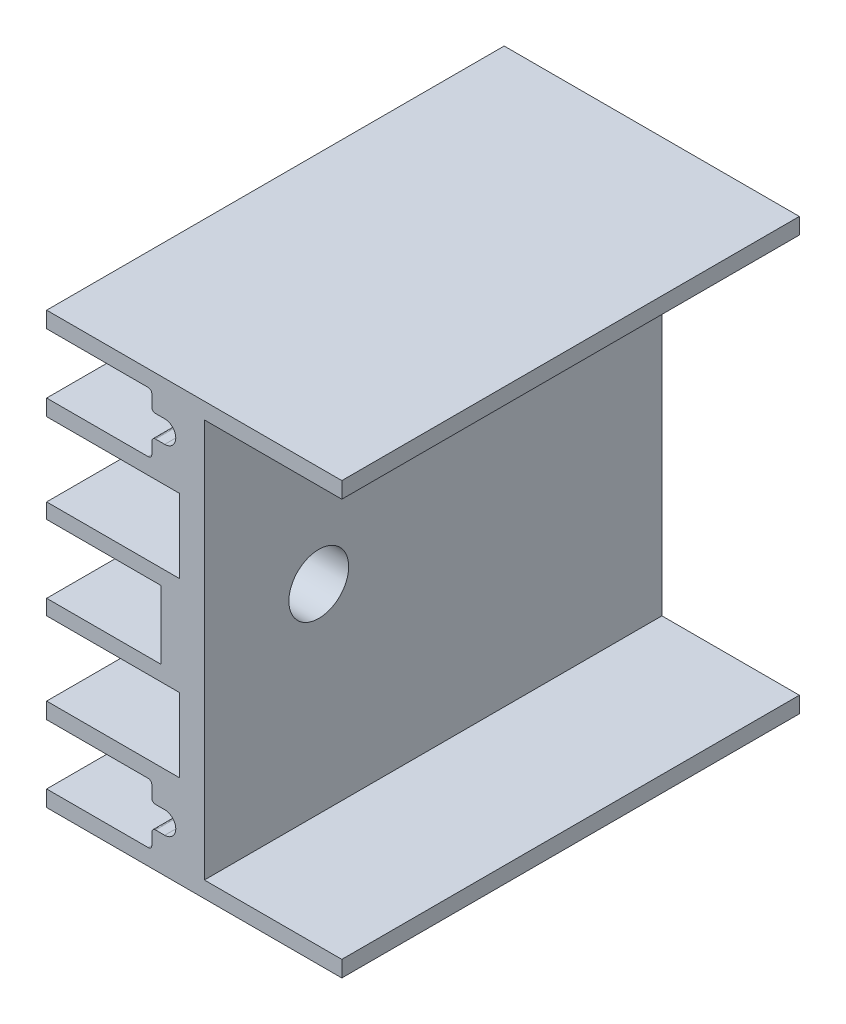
ISO-10303-21;
HEADER;
FILE_DESCRIPTION(('STEP AP214'),'2;1');
FILE_NAME('part.step','',(''),(''),'','','');
FILE_SCHEMA(('AUTOMOTIVE_DESIGN { 1 0 10303 214 1 1 1 1 }'));
ENDSEC;
DATA;
#1=APPLICATION_CONTEXT('core data for automotive mechanical design processes');
#2=APPLICATION_PROTOCOL_DEFINITION('international standard','automotive_design',2000,#1);
#3=PRODUCT_CONTEXT('',#1,'mechanical');
#4=PRODUCT('Part','Part','',(#3));
#5=PRODUCT_RELATED_PRODUCT_CATEGORY('part','',(#4));
#6=PRODUCT_DEFINITION_FORMATION('','',#4);
#7=PRODUCT_DEFINITION_CONTEXT('part definition',#1,'design');
#8=PRODUCT_DEFINITION('design','',#6,#7);
#9=PRODUCT_DEFINITION_SHAPE('','',#8);
#10=(LENGTH_UNIT() NAMED_UNIT(*) SI_UNIT(.MILLI.,.METRE.));
#11=(NAMED_UNIT(*) PLANE_ANGLE_UNIT() SI_UNIT($,.RADIAN.));
#12=(NAMED_UNIT(*) SI_UNIT($,.STERADIAN.) SOLID_ANGLE_UNIT());
#13=UNCERTAINTY_MEASURE_WITH_UNIT(LENGTH_MEASURE(1.E-05),#10,'distance_accuracy_value','');
#14=(GEOMETRIC_REPRESENTATION_CONTEXT(3) GLOBAL_UNCERTAINTY_ASSIGNED_CONTEXT((#13)) GLOBAL_UNIT_ASSIGNED_CONTEXT((#10,
#11,#12)) REPRESENTATION_CONTEXT('',''));
#15=CARTESIAN_POINT('',(0.,0.,0.));
#16=DIRECTION('',(0.,0.,1.));
#17=DIRECTION('',(1.,0.,0.));
#18=AXIS2_PLACEMENT_3D('',#15,#16,#17);
#19=CARTESIAN_POINT('',(-1.6,9.175,-1.1));
#20=DIRECTION('',(0.,0.,-1.));
#21=DIRECTION('',(-1.,0.,0.));
#22=AXIS2_PLACEMENT_3D('',#19,#20,#21);
#23=CYLINDRICAL_SURFACE('',#22,0.6);
#24=DIRECTION('',(0.,0.,-1.));
#25=VECTOR('',#24,1.);
#26=CARTESIAN_POINT('',(-1.6,8.575,12.4));
#27=LINE('',#26,#25);
#28=CARTESIAN_POINT('',(-1.6,8.575,-12.4));
#29=VERTEX_POINT('',#28);
#30=CARTESIAN_POINT('',(-1.6,8.575,12.4));
#31=VERTEX_POINT('',#30);
#32=EDGE_CURVE('E304',#29,#31,#27,.F.);
#33=ORIENTED_EDGE('',*,*,#32,.T.);
#34=CARTESIAN_POINT('',(-1.6,9.175,12.4));
#35=DIRECTION('',(0.,0.,-1.));
#36=DIRECTION('',(-1.,0.,0.));
#37=AXIS2_PLACEMENT_3D('',#34,#35,#36);
#38=CIRCLE('',#37,0.6);
#39=CARTESIAN_POINT('',(-1.6,9.775,12.4));
#40=VERTEX_POINT('',#39);
#41=EDGE_CURVE('E19',#40,#31,#38,.T.);
#42=ORIENTED_EDGE('',*,*,#41,.F.);
#43=DIRECTION('',(0.,0.,1.));
#44=VECTOR('',#43,1.);
#45=CARTESIAN_POINT('',(-1.6,9.775,12.4));
#46=LINE('',#45,#44);
#47=CARTESIAN_POINT('',(-1.6,9.775,-12.4));
#48=VERTEX_POINT('',#47);
#49=EDGE_CURVE('E301',#40,#48,#46,.F.);
#50=ORIENTED_EDGE('',*,*,#49,.T.);
#51=CARTESIAN_POINT('',(-1.6,9.175,-12.4));
#52=DIRECTION('',(0.,0.,-1.));
#53=DIRECTION('',(-1.,0.,0.));
#54=AXIS2_PLACEMENT_3D('',#51,#52,#53);
#55=CIRCLE('',#54,0.6);
#56=EDGE_CURVE('E294',#29,#48,#55,.F.);
#57=ORIENTED_EDGE('',*,*,#56,.F.);
#58=EDGE_LOOP('',(#33,#42,#50,#57));
#59=FACE_BOUND('',#58,.T.);
#60=ADVANCED_FACE('F16',(#59),#23,.F.);
#61=CARTESIAN_POINT('',(-1.6,-9.175,-1.1));
#62=DIRECTION('',(0.,0.,-1.));
#63=DIRECTION('',(-1.,0.,0.));
#64=AXIS2_PLACEMENT_3D('',#61,#62,#63);
#65=CYLINDRICAL_SURFACE('',#64,0.6);
#66=DIRECTION('',(0.,0.,1.));
#67=VECTOR('',#66,1.);
#68=CARTESIAN_POINT('',(-1.6,-9.775,12.4));
#69=LINE('',#68,#67);
#70=CARTESIAN_POINT('',(-1.6,-9.775,12.4));
#71=VERTEX_POINT('',#70);
#72=CARTESIAN_POINT('',(-1.6,-9.775,-12.4));
#73=VERTEX_POINT('',#72);
#74=EDGE_CURVE('E394',#71,#73,#69,.F.);
#75=ORIENTED_EDGE('',*,*,#74,.F.);
#76=CARTESIAN_POINT('',(-1.6,-9.175,12.4));
#77=DIRECTION('',(0.,0.,-1.));
#78=DIRECTION('',(-1.,0.,0.));
#79=AXIS2_PLACEMENT_3D('',#76,#77,#78);
#80=CIRCLE('',#79,0.6);
#81=CARTESIAN_POINT('',(-1.6,-8.575,12.4));
#82=VERTEX_POINT('',#81);
#83=EDGE_CURVE('E382',#82,#71,#80,.T.);
#84=ORIENTED_EDGE('',*,*,#83,.F.);
#85=DIRECTION('',(0.,0.,-1.));
#86=VECTOR('',#85,1.);
#87=CARTESIAN_POINT('',(-1.6,-8.575,12.4));
#88=LINE('',#87,#86);
#89=CARTESIAN_POINT('',(-1.6,-8.575,-12.4));
#90=VERTEX_POINT('',#89);
#91=EDGE_CURVE('E412',#90,#82,#88,.F.);
#92=ORIENTED_EDGE('',*,*,#91,.F.);
#93=CARTESIAN_POINT('',(-1.6,-9.175,-12.4));
#94=DIRECTION('',(0.,0.,-1.));
#95=DIRECTION('',(-1.,0.,0.));
#96=AXIS2_PLACEMENT_3D('',#93,#94,#95);
#97=CIRCLE('',#96,0.6);
#98=EDGE_CURVE('E315',#73,#90,#97,.F.);
#99=ORIENTED_EDGE('',*,*,#98,.F.);
#100=EDGE_LOOP('',(#75,#84,#92,#99));
#101=FACE_BOUND('',#100,.T.);
#102=ADVANCED_FACE('F395',(#101),#65,.F.);
#103=CARTESIAN_POINT('',(-2.1,9.775,12.4));
#104=DIRECTION('',(0.,1.,0.));
#105=DIRECTION('',(0.,0.,1.));
#106=AXIS2_PLACEMENT_3D('',#103,#104,#105);
#107=PLANE('',#106);
#108=ORIENTED_EDGE('',*,*,#49,.F.);
#109=DIRECTION('',(1.,0.,0.));
#110=VECTOR('',#109,1.);
#111=CARTESIAN_POINT('',(-2.1,9.775,12.4));
#112=LINE('',#111,#110);
#113=CARTESIAN_POINT('',(-2.1,9.775,12.4));
#114=VERTEX_POINT('',#113);
#115=EDGE_CURVE('E308',#114,#40,#112,.T.);
#116=ORIENTED_EDGE('',*,*,#115,.F.);
#117=DIRECTION('',(0.,0.,-1.));
#118=VECTOR('',#117,1.);
#119=CARTESIAN_POINT('',(-2.1,9.775,-1.1));
#120=LINE('',#119,#118);
#121=CARTESIAN_POINT('',(-2.1,9.775,-12.4));
#122=VERTEX_POINT('',#121);
#123=EDGE_CURVE('E380',#122,#114,#120,.F.);
#124=ORIENTED_EDGE('',*,*,#123,.F.);
#125=DIRECTION('',(1.,0.,0.));
#126=VECTOR('',#125,1.);
#127=CARTESIAN_POINT('',(-2.1,9.775,-12.4));
#128=LINE('',#127,#126);
#129=EDGE_CURVE('E318',#48,#122,#128,.F.);
#130=ORIENTED_EDGE('',*,*,#129,.F.);
#131=EDGE_LOOP('',(#108,#116,#124,#130));
#132=FACE_BOUND('',#131,.T.);
#133=ADVANCED_FACE('F317',(#132),#107,.F.);
#134=CARTESIAN_POINT('',(-1.6,8.575,12.4));
#135=DIRECTION('',(0.,-1.,0.));
#136=DIRECTION('',(0.,0.,-1.));
#137=AXIS2_PLACEMENT_3D('',#134,#135,#136);
#138=PLANE('',#137);
#139=DIRECTION('',(0.,0.,-1.));
#140=VECTOR('',#139,1.);
#141=CARTESIAN_POINT('',(-2.1,8.575,-1.1));
#142=LINE('',#141,#140);
#143=CARTESIAN_POINT('',(-2.1,8.575,12.4));
#144=VERTEX_POINT('',#143);
#145=CARTESIAN_POINT('',(-2.1,8.575,-12.4));
#146=VERTEX_POINT('',#145);
#147=EDGE_CURVE('E372',#144,#146,#142,.T.);
#148=ORIENTED_EDGE('',*,*,#147,.F.);
#149=DIRECTION('',(1.,0.,0.));
#150=VECTOR('',#149,1.);
#151=CARTESIAN_POINT('',(-1.6,8.575,12.4));
#152=LINE('',#151,#150);
#153=EDGE_CURVE('E417',#31,#144,#152,.F.);
#154=ORIENTED_EDGE('',*,*,#153,.F.);
#155=ORIENTED_EDGE('',*,*,#32,.F.);
#156=DIRECTION('',(1.,0.,0.));
#157=VECTOR('',#156,1.);
#158=CARTESIAN_POINT('',(-1.6,8.575,-12.4));
#159=LINE('',#158,#157);
#160=EDGE_CURVE('E415',#146,#29,#159,.T.);
#161=ORIENTED_EDGE('',*,*,#160,.F.);
#162=EDGE_LOOP('',(#148,#154,#155,#161));
#163=FACE_BOUND('',#162,.T.);
#164=ADVANCED_FACE('F829',(#163),#138,.F.);
#165=CARTESIAN_POINT('',(-1.6,-8.575,12.4));
#166=DIRECTION('',(0.,-1.,0.));
#167=DIRECTION('',(0.,0.,-1.));
#168=AXIS2_PLACEMENT_3D('',#165,#166,#167);
#169=PLANE('',#168);
#170=DIRECTION('',(0.,0.,-1.));
#171=VECTOR('',#170,1.);
#172=CARTESIAN_POINT('',(-2.1,-8.575,-1.1));
#173=LINE('',#172,#171);
#174=CARTESIAN_POINT('',(-2.1,-8.575,-12.4));
#175=VERTEX_POINT('',#174);
#176=CARTESIAN_POINT('',(-2.1,-8.575,12.4));
#177=VERTEX_POINT('',#176);
#178=EDGE_CURVE('E369',#175,#177,#173,.F.);
#179=ORIENTED_EDGE('',*,*,#178,.F.);
#180=DIRECTION('',(1.,0.,0.));
#181=VECTOR('',#180,1.);
#182=CARTESIAN_POINT('',(-1.6,-8.575,-12.4));
#183=LINE('',#182,#181);
#184=EDGE_CURVE('E402',#175,#90,#183,.T.);
#185=ORIENTED_EDGE('',*,*,#184,.T.);
#186=ORIENTED_EDGE('',*,*,#91,.T.);
#187=DIRECTION('',(1.,0.,0.));
#188=VECTOR('',#187,1.);
#189=CARTESIAN_POINT('',(-1.6,-8.575,12.4));
#190=LINE('',#189,#188);
#191=EDGE_CURVE('E389',#82,#177,#190,.F.);
#192=ORIENTED_EDGE('',*,*,#191,.T.);
#193=EDGE_LOOP('',(#179,#185,#186,#192));
#194=FACE_BOUND('',#193,.T.);
#195=ADVANCED_FACE('F421',(#194),#169,.T.);
#196=CARTESIAN_POINT('',(-2.1,-9.775,12.4));
#197=DIRECTION('',(0.,1.,0.));
#198=DIRECTION('',(0.,0.,1.));
#199=AXIS2_PLACEMENT_3D('',#196,#197,#198);
#200=PLANE('',#199);
#201=ORIENTED_EDGE('',*,*,#74,.T.);
#202=DIRECTION('',(1.,0.,0.));
#203=VECTOR('',#202,1.);
#204=CARTESIAN_POINT('',(-2.1,-9.775,-12.4));
#205=LINE('',#204,#203);
#206=CARTESIAN_POINT('',(-2.1,-9.775,-12.4));
#207=VERTEX_POINT('',#206);
#208=EDGE_CURVE('E398',#73,#207,#205,.F.);
#209=ORIENTED_EDGE('',*,*,#208,.T.);
#210=DIRECTION('',(0.,0.,-1.));
#211=VECTOR('',#210,1.);
#212=CARTESIAN_POINT('',(-2.1,-9.775,-1.1));
#213=LINE('',#212,#211);
#214=CARTESIAN_POINT('',(-2.1,-9.775,12.4));
#215=VERTEX_POINT('',#214);
#216=EDGE_CURVE('E360',#215,#207,#213,.T.);
#217=ORIENTED_EDGE('',*,*,#216,.F.);
#218=DIRECTION('',(1.,0.,0.));
#219=VECTOR('',#218,1.);
#220=CARTESIAN_POINT('',(-2.1,-9.775,12.4));
#221=LINE('',#220,#219);
#222=EDGE_CURVE('E386',#215,#71,#221,.T.);
#223=ORIENTED_EDGE('',*,*,#222,.T.);
#224=EDGE_LOOP('',(#201,#209,#217,#223));
#225=FACE_BOUND('',#224,.T.);
#226=ADVANCED_FACE('F400',(#225),#200,.T.);
#227=CARTESIAN_POINT('',(-2.1,9.975,-1.1));
#228=DIRECTION('',(0.,0.,-1.));
#229=DIRECTION('',(-1.,0.,0.));
#230=AXIS2_PLACEMENT_3D('',#227,#228,#229);
#231=CYLINDRICAL_SURFACE('',#230,0.2);
#232=DIRECTION('',(0.,0.,1.));
#233=VECTOR('',#232,1.);
#234=CARTESIAN_POINT('',(-2.3,9.975,12.4));
#235=LINE('',#234,#233);
#236=CARTESIAN_POINT('',(-2.3,9.975,-12.4));
#237=VERTEX_POINT('',#236);
#238=CARTESIAN_POINT('',(-2.3,9.975,12.4));
#239=VERTEX_POINT('',#238);
#240=EDGE_CURVE('E359',#237,#239,#235,.T.);
#241=ORIENTED_EDGE('',*,*,#240,.F.);
#242=CARTESIAN_POINT('',(-2.1,9.975,-12.4));
#243=DIRECTION('',(0.,0.,-1.));
#244=DIRECTION('',(-1.,0.,0.));
#245=AXIS2_PLACEMENT_3D('',#242,#243,#244);
#246=CIRCLE('',#245,0.2);
#247=EDGE_CURVE('E376',#237,#122,#246,.F.);
#248=ORIENTED_EDGE('',*,*,#247,.T.);
#249=ORIENTED_EDGE('',*,*,#123,.T.);
#250=CARTESIAN_POINT('',(-2.1,9.975,12.4));
#251=DIRECTION('',(0.,0.,-1.));
#252=DIRECTION('',(-1.,0.,0.));
#253=AXIS2_PLACEMENT_3D('',#250,#251,#252);
#254=CIRCLE('',#253,0.2);
#255=EDGE_CURVE('E311',#114,#239,#254,.T.);
#256=ORIENTED_EDGE('',*,*,#255,.T.);
#257=EDGE_LOOP('',(#241,#248,#249,#256));
#258=FACE_BOUND('',#257,.T.);
#259=ADVANCED_FACE('F884',(#258),#231,.T.);
#260=CARTESIAN_POINT('',(-2.1,8.375,-1.1));
#261=DIRECTION('',(0.,0.,-1.));
#262=DIRECTION('',(-1.,0.,0.));
#263=AXIS2_PLACEMENT_3D('',#260,#261,#262);
#264=CYLINDRICAL_SURFACE('',#263,0.2);
#265=ORIENTED_EDGE('',*,*,#147,.T.);
#266=CARTESIAN_POINT('',(-2.1,8.375,-12.4));
#267=DIRECTION('',(0.,0.,-1.));
#268=DIRECTION('',(-1.,0.,0.));
#269=AXIS2_PLACEMENT_3D('',#266,#267,#268);
#270=CIRCLE('',#269,0.2);
#271=CARTESIAN_POINT('',(-2.3,8.375,-12.4));
#272=VERTEX_POINT('',#271);
#273=EDGE_CURVE('E370',#146,#272,#270,.F.);
#274=ORIENTED_EDGE('',*,*,#273,.T.);
#275=DIRECTION('',(0.,0.,1.));
#276=VECTOR('',#275,1.);
#277=CARTESIAN_POINT('',(-2.3,8.375,12.4));
#278=LINE('',#277,#276);
#279=CARTESIAN_POINT('',(-2.3,8.375,12.4));
#280=VERTEX_POINT('',#279);
#281=EDGE_CURVE('E434',#280,#272,#278,.F.);
#282=ORIENTED_EDGE('',*,*,#281,.F.);
#283=CARTESIAN_POINT('',(-2.1,8.375,12.4));
#284=DIRECTION('',(0.,0.,-1.));
#285=DIRECTION('',(-1.,0.,0.));
#286=AXIS2_PLACEMENT_3D('',#283,#284,#285);
#287=CIRCLE('',#286,0.2);
#288=EDGE_CURVE('E373',#280,#144,#287,.T.);
#289=ORIENTED_EDGE('',*,*,#288,.T.);
#290=EDGE_LOOP('',(#265,#274,#282,#289));
#291=FACE_BOUND('',#290,.T.);
#292=ADVANCED_FACE('F826',(#291),#264,.T.);
#293=CARTESIAN_POINT('',(-2.1,-8.375,-1.1));
#294=DIRECTION('',(0.,0.,-1.));
#295=DIRECTION('',(-1.,0.,0.));
#296=AXIS2_PLACEMENT_3D('',#293,#294,#295);
#297=CYLINDRICAL_SURFACE('',#296,0.2);
#298=DIRECTION('',(0.,0.,1.));
#299=VECTOR('',#298,1.);
#300=CARTESIAN_POINT('',(-2.3,-8.375,12.4));
#301=LINE('',#300,#299);
#302=CARTESIAN_POINT('',(-2.3,-8.375,-12.4));
#303=VERTEX_POINT('',#302);
#304=CARTESIAN_POINT('',(-2.3,-8.375,12.4));
#305=VERTEX_POINT('',#304);
#306=EDGE_CURVE('E439',#303,#305,#301,.T.);
#307=ORIENTED_EDGE('',*,*,#306,.F.);
#308=CARTESIAN_POINT('',(-2.1,-8.375,-12.4));
#309=DIRECTION('',(0.,0.,-1.));
#310=DIRECTION('',(-1.,0.,0.));
#311=AXIS2_PLACEMENT_3D('',#308,#309,#310);
#312=CIRCLE('',#311,0.2);
#313=EDGE_CURVE('E364',#303,#175,#312,.F.);
#314=ORIENTED_EDGE('',*,*,#313,.T.);
#315=ORIENTED_EDGE('',*,*,#178,.T.);
#316=CARTESIAN_POINT('',(-2.1,-8.375,12.4));
#317=DIRECTION('',(0.,0.,-1.));
#318=DIRECTION('',(-1.,0.,0.));
#319=AXIS2_PLACEMENT_3D('',#316,#317,#318);
#320=CIRCLE('',#319,0.2);
#321=EDGE_CURVE('E367',#177,#305,#320,.T.);
#322=ORIENTED_EDGE('',*,*,#321,.T.);
#323=EDGE_LOOP('',(#307,#314,#315,#322));
#324=FACE_BOUND('',#323,.T.);
#325=ADVANCED_FACE('F901',(#324),#297,.T.);
#326=CARTESIAN_POINT('',(-2.1,-9.975,-1.1));
#327=DIRECTION('',(0.,0.,-1.));
#328=DIRECTION('',(-1.,0.,0.));
#329=AXIS2_PLACEMENT_3D('',#326,#327,#328);
#330=CYLINDRICAL_SURFACE('',#329,0.2);
#331=ORIENTED_EDGE('',*,*,#216,.T.);
#332=CARTESIAN_POINT('',(-2.1,-9.975,-12.4));
#333=DIRECTION('',(0.,0.,-1.));
#334=DIRECTION('',(-1.,0.,0.));
#335=AXIS2_PLACEMENT_3D('',#332,#333,#334);
#336=CIRCLE('',#335,0.2);
#337=CARTESIAN_POINT('',(-2.3,-9.975,-12.4));
#338=VERTEX_POINT('',#337);
#339=EDGE_CURVE('E357',#207,#338,#336,.F.);
#340=ORIENTED_EDGE('',*,*,#339,.T.);
#341=DIRECTION('',(0.,0.,1.));
#342=VECTOR('',#341,1.);
#343=CARTESIAN_POINT('',(-2.3,-9.975,12.4));
#344=LINE('',#343,#342);
#345=CARTESIAN_POINT('',(-2.3,-9.975,12.4));
#346=VERTEX_POINT('',#345);
#347=EDGE_CURVE('E443',#346,#338,#344,.F.);
#348=ORIENTED_EDGE('',*,*,#347,.F.);
#349=CARTESIAN_POINT('',(-2.1,-9.975,12.4));
#350=DIRECTION('',(0.,0.,-1.));
#351=DIRECTION('',(-1.,0.,0.));
#352=AXIS2_PLACEMENT_3D('',#349,#350,#351);
#353=CIRCLE('',#352,0.2);
#354=EDGE_CURVE('E361',#346,#215,#353,.T.);
#355=ORIENTED_EDGE('',*,*,#354,.T.);
#356=EDGE_LOOP('',(#331,#340,#348,#355));
#357=FACE_BOUND('',#356,.T.);
#358=ADVANCED_FACE('F429',(#357),#330,.T.);
#359=CARTESIAN_POINT('',(-2.3,-8.375,12.4));
#360=DIRECTION('',(-1.,0.,0.));
#361=DIRECTION('',(0.,0.,1.));
#362=AXIS2_PLACEMENT_3D('',#359,#360,#361);
#363=PLANE('',#362);
#364=DIRECTION('',(0.,0.,-1.));
#365=VECTOR('',#364,1.);
#366=CARTESIAN_POINT('',(-2.3,10.6,-1.1));
#367=LINE('',#366,#365);
#368=CARTESIAN_POINT('',(-2.3,10.6,12.4));
#369=VERTEX_POINT('',#368);
#370=CARTESIAN_POINT('',(-2.3,10.6,-12.4));
#371=VERTEX_POINT('',#370);
#372=EDGE_CURVE('E353',#369,#371,#367,.T.);
#373=ORIENTED_EDGE('',*,*,#372,.T.);
#374=DIRECTION('',(0.,1.,0.));
#375=VECTOR('',#374,1.);
#376=CARTESIAN_POINT('',(-2.3,-8.375,-12.4));
#377=LINE('',#376,#375);
#378=EDGE_CURVE('E448',#371,#237,#377,.F.);
#379=ORIENTED_EDGE('',*,*,#378,.T.);
#380=ORIENTED_EDGE('',*,*,#240,.T.);
#381=DIRECTION('',(0.,1.,0.));
#382=VECTOR('',#381,1.);
#383=CARTESIAN_POINT('',(-2.3,-8.375,12.4));
#384=LINE('',#383,#382);
#385=EDGE_CURVE('E433',#239,#369,#384,.T.);
#386=ORIENTED_EDGE('',*,*,#385,.T.);
#387=EDGE_LOOP('',(#373,#379,#380,#386));
#388=FACE_BOUND('',#387,.T.);
#389=ADVANCED_FACE('F919',(#388),#363,.T.);
#390=CARTESIAN_POINT('',(-2.3,-8.375,12.4));
#391=DIRECTION('',(-1.,0.,0.));
#392=DIRECTION('',(0.,0.,1.));
#393=AXIS2_PLACEMENT_3D('',#390,#391,#392);
#394=PLANE('',#393);
#395=ORIENTED_EDGE('',*,*,#281,.T.);
#396=DIRECTION('',(0.,1.,0.));
#397=VECTOR('',#396,1.);
#398=CARTESIAN_POINT('',(-2.3,-8.375,-12.4));
#399=LINE('',#398,#397);
#400=CARTESIAN_POINT('',(-2.3,7.75,-12.4));
#401=VERTEX_POINT('',#400);
#402=EDGE_CURVE('E437',#272,#401,#399,.F.);
#403=ORIENTED_EDGE('',*,*,#402,.T.);
#404=DIRECTION('',(0.,0.,-1.));
#405=VECTOR('',#404,1.);
#406=CARTESIAN_POINT('',(-2.3,7.75,-1.1));
#407=LINE('',#406,#405);
#408=CARTESIAN_POINT('',(-2.3,7.75,12.4));
#409=VERTEX_POINT('',#408);
#410=EDGE_CURVE('E349',#401,#409,#407,.F.);
#411=ORIENTED_EDGE('',*,*,#410,.T.);
#412=DIRECTION('',(0.,1.,0.));
#413=VECTOR('',#412,1.);
#414=CARTESIAN_POINT('',(-2.3,-8.375,12.4));
#415=LINE('',#414,#413);
#416=EDGE_CURVE('E438',#409,#280,#415,.T.);
#417=ORIENTED_EDGE('',*,*,#416,.T.);
#418=EDGE_LOOP('',(#395,#403,#411,#417));
#419=FACE_BOUND('',#418,.T.);
#420=ADVANCED_FACE('F824',(#419),#394,.T.);
#421=CARTESIAN_POINT('',(-2.3,-8.375,12.4));
#422=DIRECTION('',(-1.,0.,0.));
#423=DIRECTION('',(0.,0.,1.));
#424=AXIS2_PLACEMENT_3D('',#421,#422,#423);
#425=PLANE('',#424);
#426=DIRECTION('',(0.,0.,-1.));
#427=VECTOR('',#426,1.);
#428=CARTESIAN_POINT('',(-2.3,-7.75,-1.1));
#429=LINE('',#428,#427);
#430=CARTESIAN_POINT('',(-2.3,-7.75,12.4));
#431=VERTEX_POINT('',#430);
#432=CARTESIAN_POINT('',(-2.3,-7.75,-12.4));
#433=VERTEX_POINT('',#432);
#434=EDGE_CURVE('E339',#431,#433,#429,.T.);
#435=ORIENTED_EDGE('',*,*,#434,.T.);
#436=DIRECTION('',(0.,1.,0.));
#437=VECTOR('',#436,1.);
#438=CARTESIAN_POINT('',(-2.3,-8.375,-12.4));
#439=LINE('',#438,#437);
#440=EDGE_CURVE('E502',#433,#303,#439,.F.);
#441=ORIENTED_EDGE('',*,*,#440,.T.);
#442=ORIENTED_EDGE('',*,*,#306,.T.);
#443=DIRECTION('',(0.,1.,0.));
#444=VECTOR('',#443,1.);
#445=CARTESIAN_POINT('',(-2.3,-8.375,12.4));
#446=LINE('',#445,#444);
#447=EDGE_CURVE('E442',#305,#431,#446,.T.);
#448=ORIENTED_EDGE('',*,*,#447,.T.);
#449=EDGE_LOOP('',(#435,#441,#442,#448));
#450=FACE_BOUND('',#449,.T.);
#451=ADVANCED_FACE('F937',(#450),#425,.T.);
#452=CARTESIAN_POINT('',(-2.3,-8.375,12.4));
#453=DIRECTION('',(-1.,0.,0.));
#454=DIRECTION('',(0.,0.,1.));
#455=AXIS2_PLACEMENT_3D('',#452,#453,#454);
#456=PLANE('',#455);
#457=ORIENTED_EDGE('',*,*,#347,.T.);
#458=DIRECTION('',(0.,1.,0.));
#459=VECTOR('',#458,1.);
#460=CARTESIAN_POINT('',(-2.3,-8.375,-12.4));
#461=LINE('',#460,#459);
#462=CARTESIAN_POINT('',(-2.3,-10.6,-12.4));
#463=VERTEX_POINT('',#462);
#464=EDGE_CURVE('E356',#338,#463,#461,.F.);
#465=ORIENTED_EDGE('',*,*,#464,.T.);
#466=DIRECTION('',(0.,0.,-1.));
#467=VECTOR('',#466,1.);
#468=CARTESIAN_POINT('',(-2.3,-10.6,-1.1));
#469=LINE('',#468,#467);
#470=CARTESIAN_POINT('',(-2.3,-10.6,12.4));
#471=VERTEX_POINT('',#470);
#472=EDGE_CURVE('E335',#463,#471,#469,.F.);
#473=ORIENTED_EDGE('',*,*,#472,.T.);
#474=DIRECTION('',(0.,1.,0.));
#475=VECTOR('',#474,1.);
#476=CARTESIAN_POINT('',(-2.3,-8.375,12.4));
#477=LINE('',#476,#475);
#478=EDGE_CURVE('E445',#471,#346,#477,.T.);
#479=ORIENTED_EDGE('',*,*,#478,.T.);
#480=EDGE_LOOP('',(#457,#465,#473,#479));
#481=FACE_BOUND('',#480,.T.);
#482=ADVANCED_FACE('F946',(#481),#456,.T.);
#483=CARTESIAN_POINT('',(-2.5,10.6,-1.1));
#484=DIRECTION('',(0.,0.,-1.));
#485=DIRECTION('',(-1.,0.,0.));
#486=AXIS2_PLACEMENT_3D('',#483,#484,#485);
#487=CYLINDRICAL_SURFACE('',#486,0.2);
#488=ORIENTED_EDGE('',*,*,#372,.F.);
#489=CARTESIAN_POINT('',(-2.5,10.6,12.4));
#490=DIRECTION('',(0.,0.,-1.));
#491=DIRECTION('',(-1.,0.,0.));
#492=AXIS2_PLACEMENT_3D('',#489,#490,#491);
#493=CIRCLE('',#492,0.2);
#494=CARTESIAN_POINT('',(-2.5,10.8,12.4));
#495=VERTEX_POINT('',#494);
#496=EDGE_CURVE('E354',#495,#369,#493,.T.);
#497=ORIENTED_EDGE('',*,*,#496,.F.);
#498=DIRECTION('',(0.,0.,1.));
#499=VECTOR('',#498,1.);
#500=CARTESIAN_POINT('',(-2.5,10.8,12.4));
#501=LINE('',#500,#499);
#502=CARTESIAN_POINT('',(-2.5,10.8,-12.4));
#503=VERTEX_POINT('',#502);
#504=EDGE_CURVE('E472',#495,#503,#501,.F.);
#505=ORIENTED_EDGE('',*,*,#504,.T.);
#506=CARTESIAN_POINT('',(-2.5,10.6,-12.4));
#507=DIRECTION('',(0.,0.,-1.));
#508=DIRECTION('',(-1.,0.,0.));
#509=AXIS2_PLACEMENT_3D('',#506,#507,#508);
#510=CIRCLE('',#509,0.2);
#511=EDGE_CURVE('E350',#371,#503,#510,.F.);
#512=ORIENTED_EDGE('',*,*,#511,.F.);
#513=EDGE_LOOP('',(#488,#497,#505,#512));
#514=FACE_BOUND('',#513,.T.);
#515=ADVANCED_FACE('F956',(#514),#487,.F.);
#516=CARTESIAN_POINT('',(-8.,0.,0.));
#517=DIRECTION('',(1.,0.,0.));
#518=DIRECTION('',(0.,0.,-1.));
#519=AXIS2_PLACEMENT_3D('',#516,#517,#518);
#520=PLANE('',#519);
#521=DIRECTION('',(0.,1.,0.));
#522=VECTOR('',#521,1.);
#523=CARTESIAN_POINT('',(-8.,0.,12.4));
#524=LINE('',#523,#522);
#525=CARTESIAN_POINT('',(-8.,11.675,12.4));
#526=VERTEX_POINT('',#525);
#527=CARTESIAN_POINT('',(-8.,10.8,12.4));
#528=VERTEX_POINT('',#527);
#529=EDGE_CURVE('E479',#526,#528,#524,.F.);
#530=ORIENTED_EDGE('',*,*,#529,.F.);
#531=DIRECTION('',(0.,0.,-1.));
#532=VECTOR('',#531,1.);
#533=CARTESIAN_POINT('',(-8.,11.675,12.4));
#534=LINE('',#533,#532);
#535=CARTESIAN_POINT('',(-8.,11.675,-12.4));
#536=VERTEX_POINT('',#535);
#537=EDGE_CURVE('E469',#526,#536,#534,.T.);
#538=ORIENTED_EDGE('',*,*,#537,.T.);
#539=DIRECTION('',(0.,1.,0.));
#540=VECTOR('',#539,1.);
#541=CARTESIAN_POINT('',(-8.,0.,-12.4));
#542=LINE('',#541,#540);
#543=CARTESIAN_POINT('',(-8.,10.8,-12.4));
#544=VERTEX_POINT('',#543);
#545=EDGE_CURVE('E352',#544,#536,#542,.T.);
#546=ORIENTED_EDGE('',*,*,#545,.F.);
#547=DIRECTION('',(0.,0.,1.));
#548=VECTOR('',#547,1.);
#549=CARTESIAN_POINT('',(-8.,10.8,12.4));
#550=LINE('',#549,#548);
#551=EDGE_CURVE('E598',#544,#528,#550,.T.);
#552=ORIENTED_EDGE('',*,*,#551,.T.);
#553=EDGE_LOOP('',(#530,#538,#546,#552));
#554=FACE_BOUND('',#553,.T.);
#555=ADVANCED_FACE('F966',(#554),#520,.F.);
#556=CARTESIAN_POINT('',(-2.5,7.75,-1.1));
#557=DIRECTION('',(0.,0.,-1.));
#558=DIRECTION('',(-1.,0.,0.));
#559=AXIS2_PLACEMENT_3D('',#556,#557,#558);
#560=CYLINDRICAL_SURFACE('',#559,0.2);
#561=DIRECTION('',(0.,0.,-1.));
#562=VECTOR('',#561,1.);
#563=CARTESIAN_POINT('',(-2.5,7.55,12.4));
#564=LINE('',#563,#562);
#565=CARTESIAN_POINT('',(-2.5,7.55,-12.4));
#566=VERTEX_POINT('',#565);
#567=CARTESIAN_POINT('',(-2.5,7.55,12.4));
#568=VERTEX_POINT('',#567);
#569=EDGE_CURVE('E601',#566,#568,#564,.F.);
#570=ORIENTED_EDGE('',*,*,#569,.T.);
#571=CARTESIAN_POINT('',(-2.5,7.75,12.4));
#572=DIRECTION('',(0.,0.,-1.));
#573=DIRECTION('',(-1.,0.,0.));
#574=AXIS2_PLACEMENT_3D('',#571,#572,#573);
#575=CIRCLE('',#574,0.2);
#576=EDGE_CURVE('E347',#409,#568,#575,.T.);
#577=ORIENTED_EDGE('',*,*,#576,.F.);
#578=ORIENTED_EDGE('',*,*,#410,.F.);
#579=CARTESIAN_POINT('',(-2.5,7.75,-12.4));
#580=DIRECTION('',(0.,0.,-1.));
#581=DIRECTION('',(-1.,0.,0.));
#582=AXIS2_PLACEMENT_3D('',#579,#580,#581);
#583=CIRCLE('',#582,0.2);
#584=EDGE_CURVE('E343',#566,#401,#583,.F.);
#585=ORIENTED_EDGE('',*,*,#584,.F.);
#586=EDGE_LOOP('',(#570,#577,#578,#585));
#587=FACE_BOUND('',#586,.T.);
#588=ADVANCED_FACE('F818',(#587),#560,.F.);
#589=CARTESIAN_POINT('',(-8.,0.,0.));
#590=DIRECTION('',(1.,0.,0.));
#591=DIRECTION('',(0.,0.,-1.));
#592=AXIS2_PLACEMENT_3D('',#589,#590,#591);
#593=PLANE('',#592);
#594=DIRECTION('',(0.,1.,0.));
#595=VECTOR('',#594,1.);
#596=CARTESIAN_POINT('',(-8.,0.,-12.4));
#597=LINE('',#596,#595);
#598=CARTESIAN_POINT('',(-8.,6.675,-12.4));
#599=VERTEX_POINT('',#598);
#600=CARTESIAN_POINT('',(-8.,7.55,-12.4));
#601=VERTEX_POINT('',#600);
#602=EDGE_CURVE('E561',#599,#601,#597,.T.);
#603=ORIENTED_EDGE('',*,*,#602,.F.);
#604=DIRECTION('',(0.,0.,1.));
#605=VECTOR('',#604,1.);
#606=CARTESIAN_POINT('',(-8.,6.675,12.4));
#607=LINE('',#606,#605);
#608=CARTESIAN_POINT('',(-8.,6.675,12.4));
#609=VERTEX_POINT('',#608);
#610=EDGE_CURVE('E495',#599,#609,#607,.T.);
#611=ORIENTED_EDGE('',*,*,#610,.T.);
#612=DIRECTION('',(0.,1.,0.));
#613=VECTOR('',#612,1.);
#614=CARTESIAN_POINT('',(-8.,0.,12.4));
#615=LINE('',#614,#613);
#616=CARTESIAN_POINT('',(-8.,7.55,12.4));
#617=VERTEX_POINT('',#616);
#618=EDGE_CURVE('E346',#617,#609,#615,.F.);
#619=ORIENTED_EDGE('',*,*,#618,.F.);
#620=DIRECTION('',(0.,0.,-1.));
#621=VECTOR('',#620,1.);
#622=CARTESIAN_POINT('',(-8.,7.55,12.4));
#623=LINE('',#622,#621);
#624=EDGE_CURVE('E499',#617,#601,#623,.T.);
#625=ORIENTED_EDGE('',*,*,#624,.T.);
#626=EDGE_LOOP('',(#603,#611,#619,#625));
#627=FACE_BOUND('',#626,.T.);
#628=ADVANCED_FACE('F811',(#627),#593,.F.);
#629=CARTESIAN_POINT('',(-8.,0.,0.));
#630=DIRECTION('',(1.,0.,0.));
#631=DIRECTION('',(0.,0.,-1.));
#632=AXIS2_PLACEMENT_3D('',#629,#630,#631);
#633=PLANE('',#632);
#634=DIRECTION('',(0.,1.,0.));
#635=VECTOR('',#634,1.);
#636=CARTESIAN_POINT('',(-8.,0.,12.4));
#637=LINE('',#636,#635);
#638=CARTESIAN_POINT('',(-8.,2.675,12.4));
#639=VERTEX_POINT('',#638);
#640=CARTESIAN_POINT('',(-8.,1.85,12.4));
#641=VERTEX_POINT('',#640);
#642=EDGE_CURVE('E568',#639,#641,#637,.F.);
#643=ORIENTED_EDGE('',*,*,#642,.F.);
#644=DIRECTION('',(0.,0.,-1.));
#645=VECTOR('',#644,1.);
#646=CARTESIAN_POINT('',(-8.,2.675,12.4));
#647=LINE('',#646,#645);
#648=CARTESIAN_POINT('',(-8.,2.675,-12.4));
#649=VERTEX_POINT('',#648);
#650=EDGE_CURVE('E614',#639,#649,#647,.T.);
#651=ORIENTED_EDGE('',*,*,#650,.T.);
#652=DIRECTION('',(0.,1.,0.));
#653=VECTOR('',#652,1.);
#654=CARTESIAN_POINT('',(-8.,0.,-12.4));
#655=LINE('',#654,#653);
#656=CARTESIAN_POINT('',(-8.,1.85,-12.4));
#657=VERTEX_POINT('',#656);
#658=EDGE_CURVE('E563',#657,#649,#655,.T.);
#659=ORIENTED_EDGE('',*,*,#658,.F.);
#660=DIRECTION('',(0.,0.,1.));
#661=VECTOR('',#660,1.);
#662=CARTESIAN_POINT('',(-8.,1.85,12.4));
#663=LINE('',#662,#661);
#664=EDGE_CURVE('E617',#657,#641,#663,.T.);
#665=ORIENTED_EDGE('',*,*,#664,.T.);
#666=EDGE_LOOP('',(#643,#651,#659,#665));
#667=FACE_BOUND('',#666,.T.);
#668=ADVANCED_FACE('F793',(#667),#633,.F.);
#669=CARTESIAN_POINT('',(-8.,0.,0.));
#670=DIRECTION('',(1.,0.,0.));
#671=DIRECTION('',(0.,0.,-1.));
#672=AXIS2_PLACEMENT_3D('',#669,#670,#671);
#673=PLANE('',#672);
#674=DIRECTION('',(0.,1.,0.));
#675=VECTOR('',#674,1.);
#676=CARTESIAN_POINT('',(-8.,0.,-12.4));
#677=LINE('',#676,#675);
#678=CARTESIAN_POINT('',(-8.,-2.675,-12.4));
#679=VERTEX_POINT('',#678);
#680=CARTESIAN_POINT('',(-8.,-1.85,-12.4));
#681=VERTEX_POINT('',#680);
#682=EDGE_CURVE('E342',#679,#681,#677,.T.);
#683=ORIENTED_EDGE('',*,*,#682,.F.);
#684=DIRECTION('',(0.,0.,1.));
#685=VECTOR('',#684,1.);
#686=CARTESIAN_POINT('',(-8.,-2.675,12.4));
#687=LINE('',#686,#685);
#688=CARTESIAN_POINT('',(-8.,-2.675,12.4));
#689=VERTEX_POINT('',#688);
#690=EDGE_CURVE('E623',#679,#689,#687,.T.);
#691=ORIENTED_EDGE('',*,*,#690,.T.);
#692=DIRECTION('',(0.,1.,0.));
#693=VECTOR('',#692,1.);
#694=CARTESIAN_POINT('',(-8.,0.,12.4));
#695=LINE('',#694,#693);
#696=CARTESIAN_POINT('',(-8.,-1.85,12.4));
#697=VERTEX_POINT('',#696);
#698=EDGE_CURVE('E570',#697,#689,#695,.F.);
#699=ORIENTED_EDGE('',*,*,#698,.F.);
#700=DIRECTION('',(0.,0.,-1.));
#701=VECTOR('',#700,1.);
#702=CARTESIAN_POINT('',(-8.,-1.85,12.4));
#703=LINE('',#702,#701);
#704=EDGE_CURVE('E620',#697,#681,#703,.T.);
#705=ORIENTED_EDGE('',*,*,#704,.T.);
#706=EDGE_LOOP('',(#683,#691,#699,#705));
#707=FACE_BOUND('',#706,.T.);
#708=ADVANCED_FACE('F1001',(#707),#673,.F.);
#709=CARTESIAN_POINT('',(-2.5,-7.75,-1.1));
#710=DIRECTION('',(0.,0.,-1.));
#711=DIRECTION('',(-1.,0.,0.));
#712=AXIS2_PLACEMENT_3D('',#709,#710,#711);
#713=CYLINDRICAL_SURFACE('',#712,0.2);
#714=ORIENTED_EDGE('',*,*,#434,.F.);
#715=CARTESIAN_POINT('',(-2.5,-7.75,12.4));
#716=DIRECTION('',(0.,0.,-1.));
#717=DIRECTION('',(-1.,0.,0.));
#718=AXIS2_PLACEMENT_3D('',#715,#716,#717);
#719=CIRCLE('',#718,0.2);
#720=CARTESIAN_POINT('',(-2.5,-7.55,12.4));
#721=VERTEX_POINT('',#720);
#722=EDGE_CURVE('E340',#721,#431,#719,.T.);
#723=ORIENTED_EDGE('',*,*,#722,.F.);
#724=DIRECTION('',(0.,0.,-1.));
#725=VECTOR('',#724,1.);
#726=CARTESIAN_POINT('',(-2.5,-7.55,12.4));
#727=LINE('',#726,#725);
#728=CARTESIAN_POINT('',(-2.5,-7.55,-12.4));
#729=VERTEX_POINT('',#728);
#730=EDGE_CURVE('E526',#729,#721,#727,.F.);
#731=ORIENTED_EDGE('',*,*,#730,.F.);
#732=CARTESIAN_POINT('',(-2.5,-7.75,-12.4));
#733=DIRECTION('',(0.,0.,-1.));
#734=DIRECTION('',(-1.,0.,0.));
#735=AXIS2_PLACEMENT_3D('',#732,#733,#734);
#736=CIRCLE('',#735,0.2);
#737=EDGE_CURVE('E336',#433,#729,#736,.F.);
#738=ORIENTED_EDGE('',*,*,#737,.F.);
#739=EDGE_LOOP('',(#714,#723,#731,#738));
#740=FACE_BOUND('',#739,.T.);
#741=ADVANCED_FACE('F1010',(#740),#713,.F.);
#742=CARTESIAN_POINT('',(-8.,0.,0.));
#743=DIRECTION('',(1.,0.,0.));
#744=DIRECTION('',(0.,0.,-1.));
#745=AXIS2_PLACEMENT_3D('',#742,#743,#744);
#746=PLANE('',#745);
#747=DIRECTION('',(0.,1.,0.));
#748=VECTOR('',#747,1.);
#749=CARTESIAN_POINT('',(-8.,0.,12.4));
#750=LINE('',#749,#748);
#751=CARTESIAN_POINT('',(-8.,-6.675,12.4));
#752=VERTEX_POINT('',#751);
#753=CARTESIAN_POINT('',(-8.,-7.55,12.4));
#754=VERTEX_POINT('',#753);
#755=EDGE_CURVE('E533',#752,#754,#750,.F.);
#756=ORIENTED_EDGE('',*,*,#755,.F.);
#757=DIRECTION('',(0.,0.,-1.));
#758=VECTOR('',#757,1.);
#759=CARTESIAN_POINT('',(-8.,-6.675,12.4));
#760=LINE('',#759,#758);
#761=CARTESIAN_POINT('',(-8.,-6.675,-12.4));
#762=VERTEX_POINT('',#761);
#763=EDGE_CURVE('E523',#752,#762,#760,.T.);
#764=ORIENTED_EDGE('',*,*,#763,.T.);
#765=DIRECTION('',(0.,1.,0.));
#766=VECTOR('',#765,1.);
#767=CARTESIAN_POINT('',(-8.,0.,-12.4));
#768=LINE('',#767,#766);
#769=CARTESIAN_POINT('',(-8.,-7.55,-12.4));
#770=VERTEX_POINT('',#769);
#771=EDGE_CURVE('E338',#770,#762,#768,.T.);
#772=ORIENTED_EDGE('',*,*,#771,.F.);
#773=DIRECTION('',(0.,0.,-1.));
#774=VECTOR('',#773,1.);
#775=CARTESIAN_POINT('',(-8.,-7.55,12.4));
#776=LINE('',#775,#774);
#777=EDGE_CURVE('E632',#754,#770,#776,.T.);
#778=ORIENTED_EDGE('',*,*,#777,.F.);
#779=EDGE_LOOP('',(#756,#764,#772,#778));
#780=FACE_BOUND('',#779,.T.);
#781=ADVANCED_FACE('F1020',(#780),#746,.F.);
#782=CARTESIAN_POINT('',(-2.5,-10.6,-1.1));
#783=DIRECTION('',(0.,0.,-1.));
#784=DIRECTION('',(-1.,0.,0.));
#785=AXIS2_PLACEMENT_3D('',#782,#783,#784);
#786=CYLINDRICAL_SURFACE('',#785,0.2);
#787=DIRECTION('',(0.,0.,-1.));
#788=VECTOR('',#787,1.);
#789=CARTESIAN_POINT('',(-2.5,-10.8,12.4));
#790=LINE('',#789,#788);
#791=CARTESIAN_POINT('',(-2.5,-10.8,-12.4));
#792=VERTEX_POINT('',#791);
#793=CARTESIAN_POINT('',(-2.5,-10.8,12.4));
#794=VERTEX_POINT('',#793);
#795=EDGE_CURVE('E635',#792,#794,#790,.F.);
#796=ORIENTED_EDGE('',*,*,#795,.T.);
#797=CARTESIAN_POINT('',(-2.5,-10.6,12.4));
#798=DIRECTION('',(0.,0.,-1.));
#799=DIRECTION('',(-1.,0.,0.));
#800=AXIS2_PLACEMENT_3D('',#797,#798,#799);
#801=CIRCLE('',#800,0.2);
#802=EDGE_CURVE('E333',#471,#794,#801,.T.);
#803=ORIENTED_EDGE('',*,*,#802,.F.);
#804=ORIENTED_EDGE('',*,*,#472,.F.);
#805=CARTESIAN_POINT('',(-2.5,-10.6,-12.4));
#806=DIRECTION('',(0.,0.,-1.));
#807=DIRECTION('',(-1.,0.,0.));
#808=AXIS2_PLACEMENT_3D('',#805,#806,#807);
#809=CIRCLE('',#808,0.2);
#810=EDGE_CURVE('E329',#792,#463,#809,.F.);
#811=ORIENTED_EDGE('',*,*,#810,.F.);
#812=EDGE_LOOP('',(#796,#803,#804,#811));
#813=FACE_BOUND('',#812,.T.);
#814=ADVANCED_FACE('F1030',(#813),#786,.F.);
#815=CARTESIAN_POINT('',(-8.,0.,0.));
#816=DIRECTION('',(1.,0.,0.));
#817=DIRECTION('',(0.,0.,-1.));
#818=AXIS2_PLACEMENT_3D('',#815,#816,#817);
#819=PLANE('',#818);
#820=DIRECTION('',(0.,1.,0.));
#821=VECTOR('',#820,1.);
#822=CARTESIAN_POINT('',(-8.,0.,-12.4));
#823=LINE('',#822,#821);
#824=CARTESIAN_POINT('',(-8.,-11.675,-12.4));
#825=VERTEX_POINT('',#824);
#826=CARTESIAN_POINT('',(-8.,-10.8,-12.4));
#827=VERTEX_POINT('',#826);
#828=EDGE_CURVE('E581',#825,#827,#823,.T.);
#829=ORIENTED_EDGE('',*,*,#828,.F.);
#830=DIRECTION('',(0.,0.,1.));
#831=VECTOR('',#830,1.);
#832=CARTESIAN_POINT('',(-8.,-11.675,-12.4));
#833=LINE('',#832,#831);
#834=CARTESIAN_POINT('',(-8.,-11.675,12.4));
#835=VERTEX_POINT('',#834);
#836=EDGE_CURVE('E549',#825,#835,#833,.T.);
#837=ORIENTED_EDGE('',*,*,#836,.T.);
#838=DIRECTION('',(0.,1.,0.));
#839=VECTOR('',#838,1.);
#840=CARTESIAN_POINT('',(-8.,0.,12.4));
#841=LINE('',#840,#839);
#842=CARTESIAN_POINT('',(-8.,-10.8,12.4));
#843=VERTEX_POINT('',#842);
#844=EDGE_CURVE('E332',#843,#835,#841,.F.);
#845=ORIENTED_EDGE('',*,*,#844,.F.);
#846=DIRECTION('',(0.,0.,-1.));
#847=VECTOR('',#846,1.);
#848=CARTESIAN_POINT('',(-8.,-10.8,12.4));
#849=LINE('',#848,#847);
#850=EDGE_CURVE('E640',#843,#827,#849,.T.);
#851=ORIENTED_EDGE('',*,*,#850,.T.);
#852=EDGE_LOOP('',(#829,#837,#845,#851));
#853=FACE_BOUND('',#852,.T.);
#854=ADVANCED_FACE('F1040',(#853),#819,.F.);
#855=CARTESIAN_POINT('',(8.,0.,0.));
#856=DIRECTION('',(1.,0.,0.));
#857=DIRECTION('',(0.,0.,-1.));
#858=AXIS2_PLACEMENT_3D('',#855,#856,#857);
#859=PLANE('',#858);
#860=DIRECTION('',(0.,1.,0.));
#861=VECTOR('',#860,1.);
#862=CARTESIAN_POINT('',(8.,0.,12.4));
#863=LINE('',#862,#861);
#864=CARTESIAN_POINT('',(8.,11.675,12.4));
#865=VERTEX_POINT('',#864);
#866=CARTESIAN_POINT('',(8.,10.8,12.4));
#867=VERTEX_POINT('',#866);
#868=EDGE_CURVE('E588',#865,#867,#863,.F.);
#869=ORIENTED_EDGE('',*,*,#868,.T.);
#870=DIRECTION('',(0.,0.,1.));
#871=VECTOR('',#870,1.);
#872=CARTESIAN_POINT('',(8.,10.8,12.4));
#873=LINE('',#872,#871);
#874=CARTESIAN_POINT('',(8.,10.8,-12.4));
#875=VERTEX_POINT('',#874);
#876=EDGE_CURVE('E466',#867,#875,#873,.F.);
#877=ORIENTED_EDGE('',*,*,#876,.T.);
#878=DIRECTION('',(0.,1.,0.));
#879=VECTOR('',#878,1.);
#880=CARTESIAN_POINT('',(8.,0.,-12.4));
#881=LINE('',#880,#879);
#882=CARTESIAN_POINT('',(8.,11.675,-12.4));
#883=VERTEX_POINT('',#882);
#884=EDGE_CURVE('E583',#875,#883,#881,.T.);
#885=ORIENTED_EDGE('',*,*,#884,.T.);
#886=DIRECTION('',(0.,0.,-1.));
#887=VECTOR('',#886,1.);
#888=CARTESIAN_POINT('',(8.,11.675,12.4));
#889=LINE('',#888,#887);
#890=EDGE_CURVE('E473',#883,#865,#889,.F.);
#891=ORIENTED_EDGE('',*,*,#890,.T.);
#892=EDGE_LOOP('',(#869,#877,#885,#891));
#893=FACE_BOUND('',#892,.T.);
#894=ADVANCED_FACE('F1050',(#893),#859,.T.);
#895=CARTESIAN_POINT('',(8.,0.,0.));
#896=DIRECTION('',(1.,0.,0.));
#897=DIRECTION('',(0.,0.,-1.));
#898=AXIS2_PLACEMENT_3D('',#895,#896,#897);
#899=PLANE('',#898);
#900=DIRECTION('',(0.,1.,0.));
#901=VECTOR('',#900,1.);
#902=CARTESIAN_POINT('',(8.,0.,-12.4));
#903=LINE('',#902,#901);
#904=CARTESIAN_POINT('',(8.,-11.675,-12.4));
#905=VERTEX_POINT('',#904);
#906=CARTESIAN_POINT('',(8.,-10.8,-12.4));
#907=VERTEX_POINT('',#906);
#908=EDGE_CURVE('E590',#905,#907,#903,.T.);
#909=ORIENTED_EDGE('',*,*,#908,.T.);
#910=DIRECTION('',(0.,0.,-1.));
#911=VECTOR('',#910,1.);
#912=CARTESIAN_POINT('',(8.,-10.8,12.4));
#913=LINE('',#912,#911);
#914=CARTESIAN_POINT('',(8.,-10.8,12.4));
#915=VERTEX_POINT('',#914);
#916=EDGE_CURVE('E546',#907,#915,#913,.F.);
#917=ORIENTED_EDGE('',*,*,#916,.T.);
#918=DIRECTION('',(0.,1.,0.));
#919=VECTOR('',#918,1.);
#920=CARTESIAN_POINT('',(8.,-11.675,12.4));
#921=LINE('',#920,#919);
#922=CARTESIAN_POINT('',(8.,-11.675,12.4));
#923=VERTEX_POINT('',#922);
#924=EDGE_CURVE('E540',#915,#923,#921,.F.);
#925=ORIENTED_EDGE('',*,*,#924,.T.);
#926=DIRECTION('',(0.,0.,1.));
#927=VECTOR('',#926,1.);
#928=CARTESIAN_POINT('',(8.,-11.675,-12.4));
#929=LINE('',#928,#927);
#930=EDGE_CURVE('E552',#923,#905,#929,.F.);
#931=ORIENTED_EDGE('',*,*,#930,.T.);
#932=EDGE_LOOP('',(#909,#917,#925,#931));
#933=FACE_BOUND('',#932,.T.);
#934=ADVANCED_FACE('F1060',(#933),#899,.T.);
#935=CARTESIAN_POINT('',(0.,-11.675,-12.4));
#936=DIRECTION('',(0.,1.,0.));
#937=DIRECTION('',(0.,0.,1.));
#938=AXIS2_PLACEMENT_3D('',#935,#936,#937);
#939=PLANE('',#938);
#940=ORIENTED_EDGE('',*,*,#836,.F.);
#941=DIRECTION('',(1.,0.,0.));
#942=VECTOR('',#941,1.);
#943=CARTESIAN_POINT('',(0.,-11.675,-12.4));
#944=LINE('',#943,#942);
#945=EDGE_CURVE('E543',#825,#905,#944,.T.);
#946=ORIENTED_EDGE('',*,*,#945,.T.);
#947=ORIENTED_EDGE('',*,*,#930,.F.);
#948=DIRECTION('',(-1.,0.,0.));
#949=VECTOR('',#948,1.);
#950=CARTESIAN_POINT('',(0.,-11.675,12.4));
#951=LINE('',#950,#949);
#952=EDGE_CURVE('E536',#923,#835,#951,.T.);
#953=ORIENTED_EDGE('',*,*,#952,.T.);
#954=EDGE_LOOP('',(#940,#946,#947,#953));
#955=FACE_BOUND('',#954,.T.);
#956=ADVANCED_FACE('F1070',(#955),#939,.F.);
#957=CARTESIAN_POINT('',(0.,11.675,12.4));
#958=DIRECTION('',(0.,-1.,0.));
#959=DIRECTION('',(0.,0.,-1.));
#960=AXIS2_PLACEMENT_3D('',#957,#958,#959);
#961=PLANE('',#960);
#962=ORIENTED_EDGE('',*,*,#537,.F.);
#963=DIRECTION('',(-1.,0.,0.));
#964=VECTOR('',#963,1.);
#965=CARTESIAN_POINT('',(0.,11.675,12.4));
#966=LINE('',#965,#964);
#967=EDGE_CURVE('E462',#526,#865,#966,.F.);
#968=ORIENTED_EDGE('',*,*,#967,.T.);
#969=ORIENTED_EDGE('',*,*,#890,.F.);
#970=DIRECTION('',(1.,0.,0.));
#971=VECTOR('',#970,1.);
#972=CARTESIAN_POINT('',(0.,11.675,-12.4));
#973=LINE('',#972,#971);
#974=EDGE_CURVE('E455',#883,#536,#973,.F.);
#975=ORIENTED_EDGE('',*,*,#974,.T.);
#976=EDGE_LOOP('',(#962,#968,#969,#975));
#977=FACE_BOUND('',#976,.T.);
#978=ADVANCED_FACE('F1080',(#977),#961,.F.);
#979=CARTESIAN_POINT('',(0.55,10.8,12.4));
#980=DIRECTION('',(0.,1.,0.));
#981=DIRECTION('',(0.,0.,1.));
#982=AXIS2_PLACEMENT_3D('',#979,#980,#981);
#983=PLANE('',#982);
#984=DIRECTION('',(1.,0.,0.));
#985=VECTOR('',#984,1.);
#986=CARTESIAN_POINT('',(0.,10.8,-12.4));
#987=LINE('',#986,#985);
#988=EDGE_CURVE('E458',#544,#503,#987,.T.);
#989=ORIENTED_EDGE('',*,*,#988,.T.);
#990=ORIENTED_EDGE('',*,*,#504,.F.);
#991=DIRECTION('',(-1.,0.,0.));
#992=VECTOR('',#991,1.);
#993=CARTESIAN_POINT('',(0.,10.8,12.4));
#994=LINE('',#993,#992);
#995=EDGE_CURVE('E685',#495,#528,#994,.T.);
#996=ORIENTED_EDGE('',*,*,#995,.T.);
#997=ORIENTED_EDGE('',*,*,#551,.F.);
#998=EDGE_LOOP('',(#989,#990,#996,#997));
#999=FACE_BOUND('',#998,.T.);
#1000=ADVANCED_FACE('F1090',(#999),#983,.F.);
#1001=CARTESIAN_POINT('',(-2.5,7.55,12.4));
#1002=DIRECTION('',(0.,-1.,0.));
#1003=DIRECTION('',(0.,0.,-1.));
#1004=AXIS2_PLACEMENT_3D('',#1001,#1002,#1003);
#1005=PLANE('',#1004);
#1006=ORIENTED_EDGE('',*,*,#624,.F.);
#1007=DIRECTION('',(-1.,0.,0.));
#1008=VECTOR('',#1007,1.);
#1009=CARTESIAN_POINT('',(0.,7.55,12.4));
#1010=LINE('',#1009,#1008);
#1011=EDGE_CURVE('E485',#617,#568,#1010,.F.);
#1012=ORIENTED_EDGE('',*,*,#1011,.T.);
#1013=ORIENTED_EDGE('',*,*,#569,.F.);
#1014=DIRECTION('',(1.,0.,0.));
#1015=VECTOR('',#1014,1.);
#1016=CARTESIAN_POINT('',(0.,7.55,-12.4));
#1017=LINE('',#1016,#1015);
#1018=EDGE_CURVE('E492',#566,#601,#1017,.F.);
#1019=ORIENTED_EDGE('',*,*,#1018,.T.);
#1020=EDGE_LOOP('',(#1006,#1012,#1013,#1019));
#1021=FACE_BOUND('',#1020,.T.);
#1022=ADVANCED_FACE('F815',(#1021),#1005,.F.);
#1023=CARTESIAN_POINT('',(-9.47499947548,6.675,12.4));
#1024=DIRECTION('',(0.,1.,0.));
#1025=DIRECTION('',(0.,0.,1.));
#1026=AXIS2_PLACEMENT_3D('',#1023,#1024,#1025);
#1027=PLANE('',#1026);
#1028=DIRECTION('',(1.,0.,0.));
#1029=VECTOR('',#1028,1.);
#1030=CARTESIAN_POINT('',(0.,6.675,-12.4));
#1031=LINE('',#1030,#1029);
#1032=CARTESIAN_POINT('',(-0.8,6.675,-12.4));
#1033=VERTEX_POINT('',#1032);
#1034=EDGE_CURVE('E489',#599,#1033,#1031,.T.);
#1035=ORIENTED_EDGE('',*,*,#1034,.T.);
#1036=DIRECTION('',(0.,0.,1.));
#1037=VECTOR('',#1036,1.);
#1038=CARTESIAN_POINT('',(-0.8,6.675,12.4));
#1039=LINE('',#1038,#1037);
#1040=CARTESIAN_POINT('',(-0.8,6.675,12.4));
#1041=VERTEX_POINT('',#1040);
#1042=EDGE_CURVE('E498',#1041,#1033,#1039,.F.);
#1043=ORIENTED_EDGE('',*,*,#1042,.F.);
#1044=DIRECTION('',(-1.,0.,0.));
#1045=VECTOR('',#1044,1.);
#1046=CARTESIAN_POINT('',(0.,6.675,12.4));
#1047=LINE('',#1046,#1045);
#1048=EDGE_CURVE('E482',#1041,#609,#1047,.T.);
#1049=ORIENTED_EDGE('',*,*,#1048,.T.);
#1050=ORIENTED_EDGE('',*,*,#610,.F.);
#1051=EDGE_LOOP('',(#1035,#1043,#1049,#1050));
#1052=FACE_BOUND('',#1051,.T.);
#1053=ADVANCED_FACE('F806',(#1052),#1027,.F.);
#1054=CARTESIAN_POINT('',(-0.8,2.675,12.4));
#1055=DIRECTION('',(-1.,0.,0.));
#1056=DIRECTION('',(0.,0.,1.));
#1057=AXIS2_PLACEMENT_3D('',#1054,#1055,#1056);
#1058=PLANE('',#1057);
#1059=ORIENTED_EDGE('',*,*,#1042,.T.);
#1060=DIRECTION('',(0.,1.,0.));
#1061=VECTOR('',#1060,1.);
#1062=CARTESIAN_POINT('',(-0.8,11.675,-12.4));
#1063=LINE('',#1062,#1061);
#1064=CARTESIAN_POINT('',(-0.8,2.675,-12.4));
#1065=VERTEX_POINT('',#1064);
#1066=EDGE_CURVE('E491',#1033,#1065,#1063,.F.);
#1067=ORIENTED_EDGE('',*,*,#1066,.T.);
#1068=DIRECTION('',(0.,0.,-1.));
#1069=VECTOR('',#1068,1.);
#1070=CARTESIAN_POINT('',(-0.8,2.675,12.4));
#1071=LINE('',#1070,#1069);
#1072=CARTESIAN_POINT('',(-0.8,2.675,12.4));
#1073=VERTEX_POINT('',#1072);
#1074=EDGE_CURVE('E612',#1065,#1073,#1071,.F.);
#1075=ORIENTED_EDGE('',*,*,#1074,.T.);
#1076=DIRECTION('',(0.,1.,0.));
#1077=VECTOR('',#1076,1.);
#1078=CARTESIAN_POINT('',(-0.8,-11.675,12.4));
#1079=LINE('',#1078,#1077);
#1080=EDGE_CURVE('E486',#1073,#1041,#1079,.T.);
#1081=ORIENTED_EDGE('',*,*,#1080,.T.);
#1082=EDGE_LOOP('',(#1059,#1067,#1075,#1081));
#1083=FACE_BOUND('',#1082,.T.);
#1084=ADVANCED_FACE('F803',(#1083),#1058,.T.);
#1085=CARTESIAN_POINT('',(-0.8,2.675,12.4));
#1086=DIRECTION('',(0.,-1.,0.));
#1087=DIRECTION('',(0.,0.,-1.));
#1088=AXIS2_PLACEMENT_3D('',#1085,#1086,#1087);
#1089=PLANE('',#1088);
#1090=ORIENTED_EDGE('',*,*,#650,.F.);
#1091=DIRECTION('',(-1.,0.,0.));
#1092=VECTOR('',#1091,1.);
#1093=CARTESIAN_POINT('',(0.,2.675,12.4));
#1094=LINE('',#1093,#1092);
#1095=EDGE_CURVE('E676',#639,#1073,#1094,.F.);
#1096=ORIENTED_EDGE('',*,*,#1095,.T.);
#1097=ORIENTED_EDGE('',*,*,#1074,.F.);
#1098=DIRECTION('',(1.,0.,0.));
#1099=VECTOR('',#1098,1.);
#1100=CARTESIAN_POINT('',(0.,2.675,-12.4));
#1101=LINE('',#1100,#1099);
#1102=EDGE_CURVE('E706',#1065,#649,#1101,.F.);
#1103=ORIENTED_EDGE('',*,*,#1102,.T.);
#1104=EDGE_LOOP('',(#1090,#1096,#1097,#1103));
#1105=FACE_BOUND('',#1104,.T.);
#1106=ADVANCED_FACE('F800',(#1105),#1089,.F.);
#1107=CARTESIAN_POINT('',(-9.66865282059,1.85,12.4));
#1108=DIRECTION('',(0.,1.,0.));
#1109=DIRECTION('',(0.,0.,1.));
#1110=AXIS2_PLACEMENT_3D('',#1107,#1108,#1109);
#1111=PLANE('',#1110);
#1112=DIRECTION('',(1.,0.,0.));
#1113=VECTOR('',#1112,1.);
#1114=CARTESIAN_POINT('',(0.,1.85,-12.4));
#1115=LINE('',#1114,#1113);
#1116=CARTESIAN_POINT('',(-1.8,1.85,-12.4));
#1117=VERTEX_POINT('',#1116);
#1118=EDGE_CURVE('E709',#657,#1117,#1115,.T.);
#1119=ORIENTED_EDGE('',*,*,#1118,.T.);
#1120=DIRECTION('',(0.,0.,1.));
#1121=VECTOR('',#1120,1.);
#1122=CARTESIAN_POINT('',(-1.8,1.85,12.4));
#1123=LINE('',#1122,#1121);
#1124=CARTESIAN_POINT('',(-1.8,1.85,12.4));
#1125=VERTEX_POINT('',#1124);
#1126=EDGE_CURVE('E648',#1125,#1117,#1123,.F.);
#1127=ORIENTED_EDGE('',*,*,#1126,.F.);
#1128=DIRECTION('',(-1.,0.,0.));
#1129=VECTOR('',#1128,1.);
#1130=CARTESIAN_POINT('',(0.,1.85,12.4));
#1131=LINE('',#1130,#1129);
#1132=EDGE_CURVE('E673',#1125,#641,#1131,.T.);
#1133=ORIENTED_EDGE('',*,*,#1132,.T.);
#1134=ORIENTED_EDGE('',*,*,#664,.F.);
#1135=EDGE_LOOP('',(#1119,#1127,#1133,#1134));
#1136=FACE_BOUND('',#1135,.T.);
#1137=ADVANCED_FACE('F791',(#1136),#1111,.F.);
#1138=CARTESIAN_POINT('',(-1.8,-1.85,12.4));
#1139=DIRECTION('',(0.,-1.,0.));
#1140=DIRECTION('',(0.,0.,-1.));
#1141=AXIS2_PLACEMENT_3D('',#1138,#1139,#1140);
#1142=PLANE('',#1141);
#1143=ORIENTED_EDGE('',*,*,#704,.F.);
#1144=DIRECTION('',(-1.,0.,0.));
#1145=VECTOR('',#1144,1.);
#1146=CARTESIAN_POINT('',(0.,-1.85,12.4));
#1147=LINE('',#1146,#1145);
#1148=CARTESIAN_POINT('',(-1.8,-1.85,12.4));
#1149=VERTEX_POINT('',#1148);
#1150=EDGE_CURVE('E668',#697,#1149,#1147,.F.);
#1151=ORIENTED_EDGE('',*,*,#1150,.T.);
#1152=DIRECTION('',(0.,0.,1.));
#1153=VECTOR('',#1152,1.);
#1154=CARTESIAN_POINT('',(-1.8,-1.85,12.4));
#1155=LINE('',#1154,#1153);
#1156=CARTESIAN_POINT('',(-1.8,-1.85,-12.4));
#1157=VERTEX_POINT('',#1156);
#1158=EDGE_CURVE('E643',#1157,#1149,#1155,.T.);
#1159=ORIENTED_EDGE('',*,*,#1158,.F.);
#1160=DIRECTION('',(1.,0.,0.));
#1161=VECTOR('',#1160,1.);
#1162=CARTESIAN_POINT('',(0.,-1.85,-12.4));
#1163=LINE('',#1162,#1161);
#1164=EDGE_CURVE('E714',#1157,#681,#1163,.F.);
#1165=ORIENTED_EDGE('',*,*,#1164,.T.);
#1166=EDGE_LOOP('',(#1143,#1151,#1159,#1165));
#1167=FACE_BOUND('',#1166,.T.);
#1168=ADVANCED_FACE('F787',(#1167),#1142,.F.);
#1169=CARTESIAN_POINT('',(-9.47499947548,-2.675,12.4));
#1170=DIRECTION('',(0.,1.,0.));
#1171=DIRECTION('',(0.,0.,1.));
#1172=AXIS2_PLACEMENT_3D('',#1169,#1170,#1171);
#1173=PLANE('',#1172);
#1174=DIRECTION('',(1.,0.,0.));
#1175=VECTOR('',#1174,1.);
#1176=CARTESIAN_POINT('',(0.,-2.675,-12.4));
#1177=LINE('',#1176,#1175);
#1178=CARTESIAN_POINT('',(-0.8,-2.675,-12.4));
#1179=VERTEX_POINT('',#1178);
#1180=EDGE_CURVE('E717',#679,#1179,#1177,.T.);
#1181=ORIENTED_EDGE('',*,*,#1180,.T.);
#1182=DIRECTION('',(0.,0.,1.));
#1183=VECTOR('',#1182,1.);
#1184=CARTESIAN_POINT('',(-0.8,-2.675,12.4));
#1185=LINE('',#1184,#1183);
#1186=CARTESIAN_POINT('',(-0.8,-2.675,12.4));
#1187=VERTEX_POINT('',#1186);
#1188=EDGE_CURVE('E626',#1187,#1179,#1185,.F.);
#1189=ORIENTED_EDGE('',*,*,#1188,.F.);
#1190=DIRECTION('',(-1.,0.,0.));
#1191=VECTOR('',#1190,1.);
#1192=CARTESIAN_POINT('',(0.,-2.675,12.4));
#1193=LINE('',#1192,#1191);
#1194=EDGE_CURVE('E665',#1187,#689,#1193,.T.);
#1195=ORIENTED_EDGE('',*,*,#1194,.T.);
#1196=ORIENTED_EDGE('',*,*,#690,.F.);
#1197=EDGE_LOOP('',(#1181,#1189,#1195,#1196));
#1198=FACE_BOUND('',#1197,.T.);
#1199=ADVANCED_FACE('F1149',(#1198),#1173,.F.);
#1200=CARTESIAN_POINT('',(-0.8,2.675,12.4));
#1201=DIRECTION('',(-1.,0.,0.));
#1202=DIRECTION('',(0.,0.,1.));
#1203=AXIS2_PLACEMENT_3D('',#1200,#1201,#1202);
#1204=PLANE('',#1203);
#1205=ORIENTED_EDGE('',*,*,#1188,.T.);
#1206=DIRECTION('',(0.,1.,0.));
#1207=VECTOR('',#1206,1.);
#1208=CARTESIAN_POINT('',(-0.8,11.675,-12.4));
#1209=LINE('',#1208,#1207);
#1210=CARTESIAN_POINT('',(-0.8,-6.675,-12.4));
#1211=VERTEX_POINT('',#1210);
#1212=EDGE_CURVE('E513',#1179,#1211,#1209,.F.);
#1213=ORIENTED_EDGE('',*,*,#1212,.T.);
#1214=DIRECTION('',(0.,0.,-1.));
#1215=VECTOR('',#1214,1.);
#1216=CARTESIAN_POINT('',(-0.8,-6.675,12.4));
#1217=LINE('',#1216,#1215);
#1218=CARTESIAN_POINT('',(-0.8,-6.675,12.4));
#1219=VERTEX_POINT('',#1218);
#1220=EDGE_CURVE('E527',#1211,#1219,#1217,.F.);
#1221=ORIENTED_EDGE('',*,*,#1220,.T.);
#1222=DIRECTION('',(0.,1.,0.));
#1223=VECTOR('',#1222,1.);
#1224=CARTESIAN_POINT('',(-0.8,-11.675,12.4));
#1225=LINE('',#1224,#1223);
#1226=EDGE_CURVE('E519',#1219,#1187,#1225,.T.);
#1227=ORIENTED_EDGE('',*,*,#1226,.T.);
#1228=EDGE_LOOP('',(#1205,#1213,#1221,#1227));
#1229=FACE_BOUND('',#1228,.T.);
#1230=ADVANCED_FACE('F1158',(#1229),#1204,.T.);
#1231=CARTESIAN_POINT('',(-0.8,-6.675,12.4));
#1232=DIRECTION('',(0.,-1.,0.));
#1233=DIRECTION('',(0.,0.,-1.));
#1234=AXIS2_PLACEMENT_3D('',#1231,#1232,#1233);
#1235=PLANE('',#1234);
#1236=ORIENTED_EDGE('',*,*,#763,.F.);
#1237=DIRECTION('',(-1.,0.,0.));
#1238=VECTOR('',#1237,1.);
#1239=CARTESIAN_POINT('',(0.,-6.675,12.4));
#1240=LINE('',#1239,#1238);
#1241=EDGE_CURVE('E516',#752,#1219,#1240,.F.);
#1242=ORIENTED_EDGE('',*,*,#1241,.T.);
#1243=ORIENTED_EDGE('',*,*,#1220,.F.);
#1244=DIRECTION('',(1.,0.,0.));
#1245=VECTOR('',#1244,1.);
#1246=CARTESIAN_POINT('',(0.,-6.675,-12.4));
#1247=LINE('',#1246,#1245);
#1248=EDGE_CURVE('E509',#1211,#762,#1247,.F.);
#1249=ORIENTED_EDGE('',*,*,#1248,.T.);
#1250=EDGE_LOOP('',(#1236,#1242,#1243,#1249));
#1251=FACE_BOUND('',#1250,.T.);
#1252=ADVANCED_FACE('F1168',(#1251),#1235,.F.);
#1253=CARTESIAN_POINT('',(-2.5,-7.55,12.4));
#1254=DIRECTION('',(0.,-1.,0.));
#1255=DIRECTION('',(0.,0.,-1.));
#1256=AXIS2_PLACEMENT_3D('',#1253,#1254,#1255);
#1257=PLANE('',#1256);
#1258=ORIENTED_EDGE('',*,*,#777,.T.);
#1259=DIRECTION('',(1.,0.,0.));
#1260=VECTOR('',#1259,1.);
#1261=CARTESIAN_POINT('',(0.,-7.55,-12.4));
#1262=LINE('',#1261,#1260);
#1263=EDGE_CURVE('E512',#770,#729,#1262,.T.);
#1264=ORIENTED_EDGE('',*,*,#1263,.T.);
#1265=ORIENTED_EDGE('',*,*,#730,.T.);
#1266=DIRECTION('',(-1.,0.,0.));
#1267=VECTOR('',#1266,1.);
#1268=CARTESIAN_POINT('',(0.,-7.55,12.4));
#1269=LINE('',#1268,#1267);
#1270=EDGE_CURVE('E520',#721,#754,#1269,.T.);
#1271=ORIENTED_EDGE('',*,*,#1270,.T.);
#1272=EDGE_LOOP('',(#1258,#1264,#1265,#1271));
#1273=FACE_BOUND('',#1272,.T.);
#1274=ADVANCED_FACE('F1178',(#1273),#1257,.T.);
#1275=CARTESIAN_POINT('',(11.6623544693,-10.8,12.4));
#1276=DIRECTION('',(0.,-1.,0.));
#1277=DIRECTION('',(0.,0.,-1.));
#1278=AXIS2_PLACEMENT_3D('',#1275,#1276,#1277);
#1279=PLANE('',#1278);
#1280=ORIENTED_EDGE('',*,*,#850,.F.);
#1281=DIRECTION('',(-1.,0.,0.));
#1282=VECTOR('',#1281,1.);
#1283=CARTESIAN_POINT('',(0.,-10.8,12.4));
#1284=LINE('',#1283,#1282);
#1285=EDGE_CURVE('E539',#843,#794,#1284,.F.);
#1286=ORIENTED_EDGE('',*,*,#1285,.T.);
#1287=ORIENTED_EDGE('',*,*,#795,.F.);
#1288=DIRECTION('',(1.,0.,0.));
#1289=VECTOR('',#1288,1.);
#1290=CARTESIAN_POINT('',(0.,-10.8,-12.4));
#1291=LINE('',#1290,#1289);
#1292=EDGE_CURVE('E328',#792,#827,#1291,.F.);
#1293=ORIENTED_EDGE('',*,*,#1292,.T.);
#1294=EDGE_LOOP('',(#1280,#1286,#1287,#1293));
#1295=FACE_BOUND('',#1294,.T.);
#1296=ADVANCED_FACE('F776',(#1295),#1279,.F.);
#1297=CARTESIAN_POINT('',(-1.8,-1.85,12.4));
#1298=DIRECTION('',(-1.,0.,0.));
#1299=DIRECTION('',(0.,0.,1.));
#1300=AXIS2_PLACEMENT_3D('',#1297,#1298,#1299);
#1301=PLANE('',#1300);
#1302=CARTESIAN_POINT('',(-1.8,0.,6.2));
#1303=DIRECTION('',(-1.,0.,0.));
#1304=DIRECTION('',(0.,0.,1.));
#1305=AXIS2_PLACEMENT_3D('',#1302,#1303,#1304);
#1306=CIRCLE('',#1305,1.621);
#1307=CARTESIAN_POINT('',(-1.8,0.,7.821));
#1308=VERTEX_POINT('',#1307);
#1309=EDGE_CURVE('E324',#1308,#1308,#1306,.F.);
#1310=ORIENTED_EDGE('',*,*,#1309,.T.);
#1311=EDGE_LOOP('',(#1310));
#1312=FACE_BOUND('',#1311,.T.);
#1313=ORIENTED_EDGE('',*,*,#1126,.T.);
#1314=DIRECTION('',(0.,1.,0.));
#1315=VECTOR('',#1314,1.);
#1316=CARTESIAN_POINT('',(-1.8,11.675,-12.4));
#1317=LINE('',#1316,#1315);
#1318=EDGE_CURVE('E711',#1117,#1157,#1317,.F.);
#1319=ORIENTED_EDGE('',*,*,#1318,.T.);
#1320=ORIENTED_EDGE('',*,*,#1158,.T.);
#1321=DIRECTION('',(0.,1.,0.));
#1322=VECTOR('',#1321,1.);
#1323=CARTESIAN_POINT('',(-1.8,-11.675,12.4));
#1324=LINE('',#1323,#1322);
#1325=EDGE_CURVE('E670',#1149,#1125,#1324,.T.);
#1326=ORIENTED_EDGE('',*,*,#1325,.T.);
#1327=EDGE_LOOP('',(#1313,#1319,#1320,#1326));
#1328=FACE_BOUND('',#1327,.T.);
#1329=ADVANCED_FACE('F773',(#1312,#1328),#1301,.T.);
#1330=CARTESIAN_POINT('',(0.55,10.8,12.4));
#1331=DIRECTION('',(0.,1.,0.));
#1332=DIRECTION('',(0.,0.,1.));
#1333=AXIS2_PLACEMENT_3D('',#1330,#1331,#1332);
#1334=PLANE('',#1333);
#1335=ORIENTED_EDGE('',*,*,#876,.F.);
#1336=DIRECTION('',(-1.,0.,0.));
#1337=VECTOR('',#1336,1.);
#1338=CARTESIAN_POINT('',(0.,10.8,12.4));
#1339=LINE('',#1338,#1337);
#1340=CARTESIAN_POINT('',(0.55,10.8,12.4));
#1341=VERTEX_POINT('',#1340);
#1342=EDGE_CURVE('E465',#867,#1341,#1339,.T.);
#1343=ORIENTED_EDGE('',*,*,#1342,.T.);
#1344=DIRECTION('',(0.,0.,-1.));
#1345=VECTOR('',#1344,1.);
#1346=CARTESIAN_POINT('',(0.55,10.8,12.4));
#1347=LINE('',#1346,#1345);
#1348=CARTESIAN_POINT('',(0.55,10.8,-12.4));
#1349=VERTEX_POINT('',#1348);
#1350=EDGE_CURVE('E327',#1349,#1341,#1347,.F.);
#1351=ORIENTED_EDGE('',*,*,#1350,.F.);
#1352=DIRECTION('',(1.,0.,0.));
#1353=VECTOR('',#1352,1.);
#1354=CARTESIAN_POINT('',(0.,10.8,-12.4));
#1355=LINE('',#1354,#1353);
#1356=EDGE_CURVE('E459',#1349,#875,#1355,.T.);
#1357=ORIENTED_EDGE('',*,*,#1356,.T.);
#1358=EDGE_LOOP('',(#1335,#1343,#1351,#1357));
#1359=FACE_BOUND('',#1358,.T.);
#1360=ADVANCED_FACE('F743',(#1359),#1334,.F.);
#1361=CARTESIAN_POINT('',(0.,-11.675,12.4));
#1362=DIRECTION('',(0.,0.,-1.));
#1363=DIRECTION('',(-1.,0.,0.));
#1364=AXIS2_PLACEMENT_3D('',#1361,#1362,#1363);
#1365=PLANE('',#1364);
#1366=ORIENTED_EDGE('',*,*,#496,.T.);
#1367=ORIENTED_EDGE('',*,*,#385,.F.);
#1368=ORIENTED_EDGE('',*,*,#255,.F.);
#1369=ORIENTED_EDGE('',*,*,#115,.T.);
#1370=ORIENTED_EDGE('',*,*,#41,.T.);
#1371=ORIENTED_EDGE('',*,*,#153,.T.);
#1372=ORIENTED_EDGE('',*,*,#288,.F.);
#1373=ORIENTED_EDGE('',*,*,#416,.F.);
#1374=ORIENTED_EDGE('',*,*,#576,.T.);
#1375=ORIENTED_EDGE('',*,*,#1011,.F.);
#1376=ORIENTED_EDGE('',*,*,#618,.T.);
#1377=ORIENTED_EDGE('',*,*,#1048,.F.);
#1378=ORIENTED_EDGE('',*,*,#1080,.F.);
#1379=ORIENTED_EDGE('',*,*,#1095,.F.);
#1380=ORIENTED_EDGE('',*,*,#642,.T.);
#1381=ORIENTED_EDGE('',*,*,#1132,.F.);
#1382=ORIENTED_EDGE('',*,*,#1325,.F.);
#1383=ORIENTED_EDGE('',*,*,#1150,.F.);
#1384=ORIENTED_EDGE('',*,*,#698,.T.);
#1385=ORIENTED_EDGE('',*,*,#1194,.F.);
#1386=ORIENTED_EDGE('',*,*,#1226,.F.);
#1387=ORIENTED_EDGE('',*,*,#1241,.F.);
#1388=ORIENTED_EDGE('',*,*,#755,.T.);
#1389=ORIENTED_EDGE('',*,*,#1270,.F.);
#1390=ORIENTED_EDGE('',*,*,#722,.T.);
#1391=ORIENTED_EDGE('',*,*,#447,.F.);
#1392=ORIENTED_EDGE('',*,*,#321,.F.);
#1393=ORIENTED_EDGE('',*,*,#191,.F.);
#1394=ORIENTED_EDGE('',*,*,#83,.T.);
#1395=ORIENTED_EDGE('',*,*,#222,.F.);
#1396=ORIENTED_EDGE('',*,*,#354,.F.);
#1397=ORIENTED_EDGE('',*,*,#478,.F.);
#1398=ORIENTED_EDGE('',*,*,#802,.T.);
#1399=ORIENTED_EDGE('',*,*,#1285,.F.);
#1400=ORIENTED_EDGE('',*,*,#844,.T.);
#1401=ORIENTED_EDGE('',*,*,#952,.F.);
#1402=ORIENTED_EDGE('',*,*,#924,.F.);
#1403=DIRECTION('',(1.,0.,0.));
#1404=VECTOR('',#1403,1.);
#1405=CARTESIAN_POINT('',(11.6623544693,-10.8,12.4));
#1406=LINE('',#1405,#1404);
#1407=CARTESIAN_POINT('',(0.55,-10.8,12.4));
#1408=VERTEX_POINT('',#1407);
#1409=EDGE_CURVE('E690',#915,#1408,#1406,.F.);
#1410=ORIENTED_EDGE('',*,*,#1409,.T.);
#1411=DIRECTION('',(0.,1.,0.));
#1412=VECTOR('',#1411,1.);
#1413=CARTESIAN_POINT('',(0.55,10.8,12.4));
#1414=LINE('',#1413,#1412);
#1415=EDGE_CURVE('E730',#1341,#1408,#1414,.F.);
#1416=ORIENTED_EDGE('',*,*,#1415,.F.);
#1417=ORIENTED_EDGE('',*,*,#1342,.F.);
#1418=ORIENTED_EDGE('',*,*,#868,.F.);
#1419=ORIENTED_EDGE('',*,*,#967,.F.);
#1420=ORIENTED_EDGE('',*,*,#529,.T.);
#1421=ORIENTED_EDGE('',*,*,#995,.F.);
#1422=EDGE_LOOP('',(#1366,#1367,#1368,#1369,#1370,#1371,#1372,#1373,#1374,#1375,#1376,#1377,
#1378,#1379,#1380,#1381,#1382,#1383,#1384,#1385,#1386,#1387,#1388,#1389,#1390,#1391,#1392,#1393,
#1394,#1395,#1396,#1397,#1398,#1399,#1400,#1401,#1402,#1410,#1416,#1417,#1418,#1419,#1420,#1421));
#1423=FACE_BOUND('',#1422,.T.);
#1424=ADVANCED_FACE('F309',(#1423),#1365,.F.);
#1425=CARTESIAN_POINT('',(11.6623544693,-10.8,12.4));
#1426=DIRECTION('',(0.,-1.,0.));
#1427=DIRECTION('',(0.,0.,-1.));
#1428=AXIS2_PLACEMENT_3D('',#1425,#1426,#1427);
#1429=PLANE('',#1428);
#1430=DIRECTION('',(1.,0.,0.));
#1431=VECTOR('',#1430,1.);
#1432=CARTESIAN_POINT('',(0.,-10.8,-12.4));
#1433=LINE('',#1432,#1431);
#1434=CARTESIAN_POINT('',(0.55,-10.8,-12.4));
#1435=VERTEX_POINT('',#1434);
#1436=EDGE_CURVE('E34',#907,#1435,#1433,.F.);
#1437=ORIENTED_EDGE('',*,*,#1436,.T.);
#1438=DIRECTION('',(0.,0.,-1.));
#1439=VECTOR('',#1438,1.);
#1440=CARTESIAN_POINT('',(0.55,-10.8,12.4));
#1441=LINE('',#1440,#1439);
#1442=EDGE_CURVE('E733',#1408,#1435,#1441,.T.);
#1443=ORIENTED_EDGE('',*,*,#1442,.F.);
#1444=ORIENTED_EDGE('',*,*,#1409,.F.);
#1445=ORIENTED_EDGE('',*,*,#916,.F.);
#1446=EDGE_LOOP('',(#1437,#1443,#1444,#1445));
#1447=FACE_BOUND('',#1446,.T.);
#1448=ADVANCED_FACE('F748',(#1447),#1429,.F.);
#1449=CARTESIAN_POINT('',(0.,11.675,-12.4));
#1450=DIRECTION('',(0.,0.,1.));
#1451=DIRECTION('',(1.,0.,0.));
#1452=AXIS2_PLACEMENT_3D('',#1449,#1450,#1451);
#1453=PLANE('',#1452);
#1454=ORIENTED_EDGE('',*,*,#810,.T.);
#1455=ORIENTED_EDGE('',*,*,#464,.F.);
#1456=ORIENTED_EDGE('',*,*,#339,.F.);
#1457=ORIENTED_EDGE('',*,*,#208,.F.);
#1458=ORIENTED_EDGE('',*,*,#98,.T.);
#1459=ORIENTED_EDGE('',*,*,#184,.F.);
#1460=ORIENTED_EDGE('',*,*,#313,.F.);
#1461=ORIENTED_EDGE('',*,*,#440,.F.);
#1462=ORIENTED_EDGE('',*,*,#737,.T.);
#1463=ORIENTED_EDGE('',*,*,#1263,.F.);
#1464=ORIENTED_EDGE('',*,*,#771,.T.);
#1465=ORIENTED_EDGE('',*,*,#1248,.F.);
#1466=ORIENTED_EDGE('',*,*,#1212,.F.);
#1467=ORIENTED_EDGE('',*,*,#1180,.F.);
#1468=ORIENTED_EDGE('',*,*,#682,.T.);
#1469=ORIENTED_EDGE('',*,*,#1164,.F.);
#1470=ORIENTED_EDGE('',*,*,#1318,.F.);
#1471=ORIENTED_EDGE('',*,*,#1118,.F.);
#1472=ORIENTED_EDGE('',*,*,#658,.T.);
#1473=ORIENTED_EDGE('',*,*,#1102,.F.);
#1474=ORIENTED_EDGE('',*,*,#1066,.F.);
#1475=ORIENTED_EDGE('',*,*,#1034,.F.);
#1476=ORIENTED_EDGE('',*,*,#602,.T.);
#1477=ORIENTED_EDGE('',*,*,#1018,.F.);
#1478=ORIENTED_EDGE('',*,*,#584,.T.);
#1479=ORIENTED_EDGE('',*,*,#402,.F.);
#1480=ORIENTED_EDGE('',*,*,#273,.F.);
#1481=ORIENTED_EDGE('',*,*,#160,.T.);
#1482=ORIENTED_EDGE('',*,*,#56,.T.);
#1483=ORIENTED_EDGE('',*,*,#129,.T.);
#1484=ORIENTED_EDGE('',*,*,#247,.F.);
#1485=ORIENTED_EDGE('',*,*,#378,.F.);
#1486=ORIENTED_EDGE('',*,*,#511,.T.);
#1487=ORIENTED_EDGE('',*,*,#988,.F.);
#1488=ORIENTED_EDGE('',*,*,#545,.T.);
#1489=ORIENTED_EDGE('',*,*,#974,.F.);
#1490=ORIENTED_EDGE('',*,*,#884,.F.);
#1491=ORIENTED_EDGE('',*,*,#1356,.F.);
#1492=DIRECTION('',(0.,1.,0.));
#1493=VECTOR('',#1492,1.);
#1494=CARTESIAN_POINT('',(0.55,10.8,-12.4));
#1495=LINE('',#1494,#1493);
#1496=EDGE_CURVE('E25',#1435,#1349,#1495,.T.);
#1497=ORIENTED_EDGE('',*,*,#1496,.F.);
#1498=ORIENTED_EDGE('',*,*,#1436,.F.);
#1499=ORIENTED_EDGE('',*,*,#908,.F.);
#1500=ORIENTED_EDGE('',*,*,#945,.F.);
#1501=ORIENTED_EDGE('',*,*,#828,.T.);
#1502=ORIENTED_EDGE('',*,*,#1292,.F.);
#1503=EDGE_LOOP('',(#1454,#1455,#1456,#1457,#1458,#1459,#1460,#1461,#1462,#1463,#1464,#1465,
#1466,#1467,#1468,#1469,#1470,#1471,#1472,#1473,#1474,#1475,#1476,#1477,#1478,#1479,#1480,#1481,
#1482,#1483,#1484,#1485,#1486,#1487,#1488,#1489,#1490,#1491,#1497,#1498,#1499,#1500,#1501,#1502));
#1504=FACE_BOUND('',#1503,.T.);
#1505=ADVANCED_FACE('F422',(#1504),#1453,.F.);
#1506=CARTESIAN_POINT('',(0.45,0.,6.2));
#1507=DIRECTION('',(-1.,0.,0.));
#1508=DIRECTION('',(0.,0.,1.));
#1509=AXIS2_PLACEMENT_3D('',#1506,#1507,#1508);
#1510=CYLINDRICAL_SURFACE('',#1509,1.621);
#1511=ORIENTED_EDGE('',*,*,#1309,.F.);
#1512=EDGE_LOOP('',(#1511));
#1513=FACE_BOUND('',#1512,.T.);
#1514=CARTESIAN_POINT('',(0.55,0.,6.2));
#1515=DIRECTION('',(-1.,0.,0.));
#1516=DIRECTION('',(0.,0.,1.));
#1517=AXIS2_PLACEMENT_3D('',#1514,#1515,#1516);
#1518=CIRCLE('',#1517,1.621);
#1519=CARTESIAN_POINT('',(0.55,0.,7.821));
#1520=VERTEX_POINT('',#1519);
#1521=EDGE_CURVE('E11',#1520,#1520,#1518,.T.);
#1522=ORIENTED_EDGE('',*,*,#1521,.F.);
#1523=EDGE_LOOP('',(#1522));
#1524=FACE_BOUND('',#1523,.T.);
#1525=ADVANCED_FACE('F756',(#1513,#1524),#1510,.F.);
#1526=CARTESIAN_POINT('',(0.55,10.8,12.4));
#1527=DIRECTION('',(1.,0.,0.));
#1528=DIRECTION('',(0.,0.,-1.));
#1529=AXIS2_PLACEMENT_3D('',#1526,#1527,#1528);
#1530=PLANE('',#1529);
#1531=ORIENTED_EDGE('',*,*,#1521,.T.);
#1532=EDGE_LOOP('',(#1531));
#1533=FACE_BOUND('',#1532,.T.);
#1534=ORIENTED_EDGE('',*,*,#1442,.T.);
#1535=ORIENTED_EDGE('',*,*,#1496,.T.);
#1536=ORIENTED_EDGE('',*,*,#1350,.T.);
#1537=ORIENTED_EDGE('',*,*,#1415,.T.);
#1538=EDGE_LOOP('',(#1534,#1535,#1536,#1537));
#1539=FACE_BOUND('',#1538,.T.);
#1540=ADVANCED_FACE('F738',(#1533,#1539),#1530,.T.);
#1541=CLOSED_SHELL('',(#60,#102,#133,#164,#195,#226,#259,#292,#325,#358,#389,#420,#451,#482,
#515,#555,#588,#628,#668,#708,#741,#781,#814,#854,#894,#934,#956,#978,#1000,#1022,#1053,#1084,
#1106,#1137,#1168,#1199,#1230,#1252,#1274,#1296,#1329,#1360,#1424,#1448,#1505,#1525,#1540));
#1542=MANIFOLD_SOLID_BREP('B1',#1541);
#1543=ADVANCED_BREP_SHAPE_REPRESENTATION('',(#18,#1542),#14);
#1544=SHAPE_DEFINITION_REPRESENTATION(#9,#1543);
ENDSEC;
END-ISO-10303-21;
